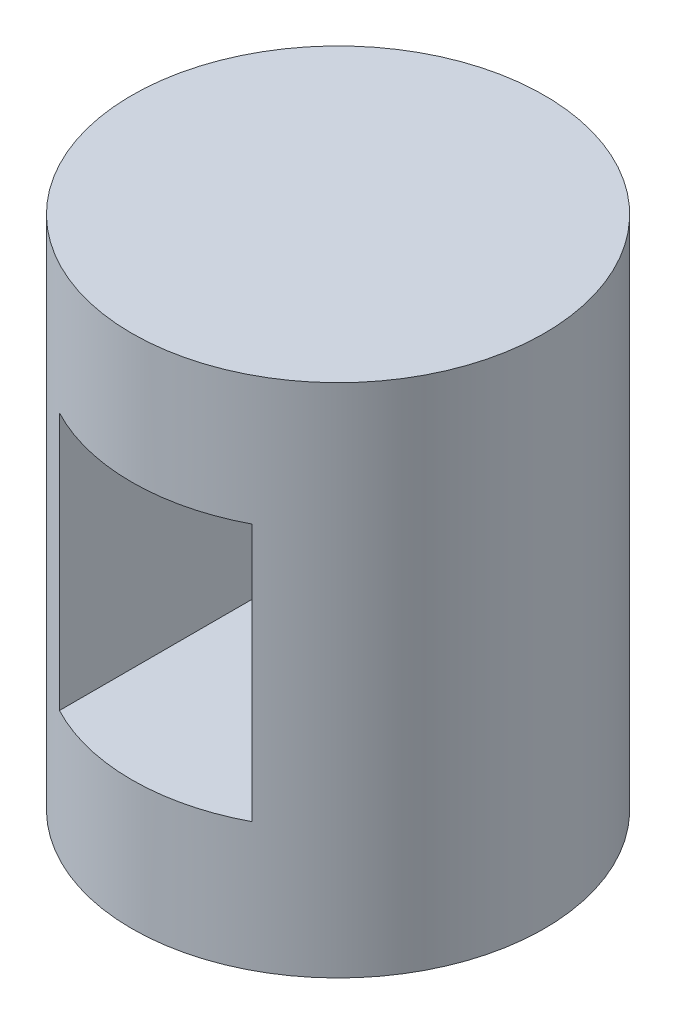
from build123d import *

# Parameters (mm, degrees)
SKETCH_1_R          = 30
EXTRUDE_1_DEPTH     = 75
SKETCH_4_W          = 28
SKETCH_4_H          = 37.5
CUT_EXTRUDE_3_DEPTH = 30


with BuildPart() as part:
    # Sketch 1 → Extrude 1 (new body)
    with BuildSketch(Plane(origin=(0, 0, 0), x_dir=(1, 0, 0), z_dir=(0, 1, 0))):
        with Locations(Location((0, 0, 0), (0, 0, 270))):
            Circle(SKETCH_1_R)
    extrude(amount=EXTRUDE_1_DEPTH)

    # Sketch 4 → Cut-Extrude 3 (cut, symmetric)
    with BuildSketch(Plane.XY):
        with Locations((0, 37.5)):
            Rectangle(SKETCH_4_W, SKETCH_4_H)
    extrude(amount=CUT_EXTRUDE_3_DEPTH, both=True, mode=Mode.SUBTRACT)


solid = part.part
